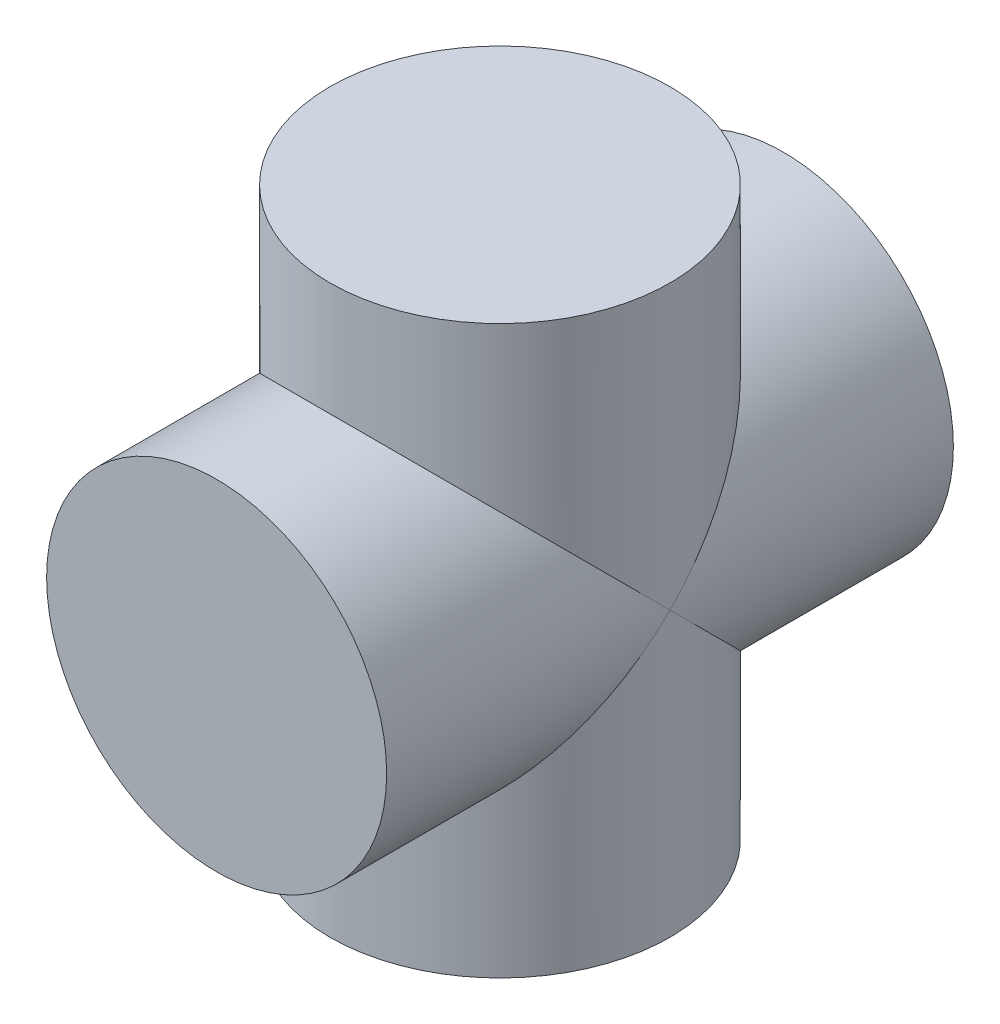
from build123d import *

# Parameters (mm, degrees)
SKETCH_1_R      = 6
EXTRUDE_1_DEPTH = 20
SKETCH_2_R      = 6
EXTRUDE_2_DEPTH = 10


with BuildPart() as part:
    # Sketch 1 → Extrude 1 (new body)
    with BuildSketch(Plane(origin=(0, 0, 0), x_dir=(1, 0, 0), z_dir=(0, 1, 0))):
        with Locations(Location((0, 0, 0), (0, 0, 270))):
            Circle(SKETCH_1_R)
    extrude(amount=EXTRUDE_1_DEPTH)

    # Sketch 2 → Extrude 2 (add, symmetric)
    with BuildSketch(Plane.XY):
        with Locations((0, 10)):
            Circle(SKETCH_2_R)
    extrude(amount=EXTRUDE_2_DEPTH, both=True)


solid = part.part
